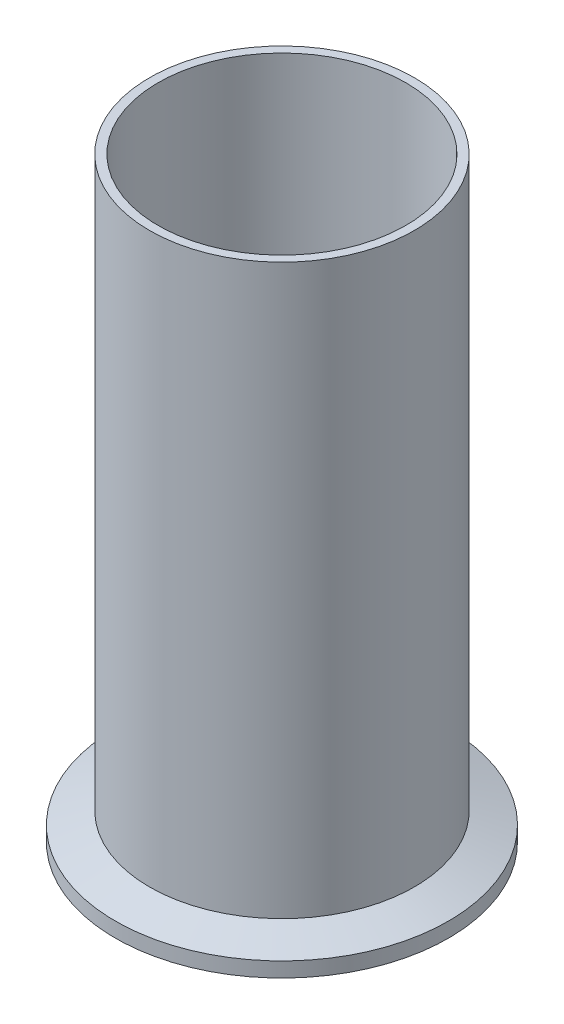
ISO-10303-21;
HEADER;
FILE_DESCRIPTION(('STEP AP214'),'2;1');
FILE_NAME('part.step','',(''),(''),'','','');
FILE_SCHEMA(('AUTOMOTIVE_DESIGN { 1 0 10303 214 1 1 1 1 }'));
ENDSEC;
DATA;
#1=APPLICATION_CONTEXT('core data for automotive mechanical design processes');
#2=APPLICATION_PROTOCOL_DEFINITION('international standard','automotive_design',2000,#1);
#3=PRODUCT_CONTEXT('',#1,'mechanical');
#4=PRODUCT('Part','Part','',(#3));
#5=PRODUCT_RELATED_PRODUCT_CATEGORY('part','',(#4));
#6=PRODUCT_DEFINITION_FORMATION('','',#4);
#7=PRODUCT_DEFINITION_CONTEXT('part definition',#1,'design');
#8=PRODUCT_DEFINITION('design','',#6,#7);
#9=PRODUCT_DEFINITION_SHAPE('','',#8);
#10=(LENGTH_UNIT() NAMED_UNIT(*) SI_UNIT(.MILLI.,.METRE.));
#11=(NAMED_UNIT(*) PLANE_ANGLE_UNIT() SI_UNIT($,.RADIAN.));
#12=(NAMED_UNIT(*) SI_UNIT($,.STERADIAN.) SOLID_ANGLE_UNIT());
#13=UNCERTAINTY_MEASURE_WITH_UNIT(LENGTH_MEASURE(1.E-05),#10,'distance_accuracy_value','');
#14=(GEOMETRIC_REPRESENTATION_CONTEXT(3) GLOBAL_UNCERTAINTY_ASSIGNED_CONTEXT((#13)) GLOBAL_UNIT_ASSIGNED_CONTEXT((#10,
#11,#12)) REPRESENTATION_CONTEXT('',''));
#15=CARTESIAN_POINT('',(0.,0.,0.));
#16=DIRECTION('',(0.,0.,1.));
#17=DIRECTION('',(1.,0.,0.));
#18=AXIS2_PLACEMENT_3D('',#15,#16,#17);
#19=CARTESIAN_POINT('',(0.,0.7874,0.));
#20=DIRECTION('',(0.,-1.,0.));
#21=DIRECTION('',(0.,0.,-1.));
#22=AXIS2_PLACEMENT_3D('',#19,#20,#21);
#23=TOROIDAL_SURFACE('',#22,29.9866084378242,0.787399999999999);
#24=CARTESIAN_POINT('',(0.,0.,0.));
#25=DIRECTION('',(0.,-1.,0.));
#26=DIRECTION('',(0.,0.,-1.));
#27=AXIS2_PLACEMENT_3D('',#24,#25,#26);
#28=CIRCLE('',#27,29.9866084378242);
#29=CARTESIAN_POINT('',(0.,0.,-29.9866084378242));
#30=VERTEX_POINT('',#29);
#31=EDGE_CURVE('E67',#30,#30,#28,.T.);
#32=ORIENTED_EDGE('',*,*,#31,.T.);
#33=EDGE_LOOP('',(#32));
#34=FACE_BOUND('',#33,.T.);
#35=CARTESIAN_POINT('',(0.,0.474458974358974,0.));
#36=DIRECTION('',(0.,-1.,0.));
#37=DIRECTION('',(0.,0.,-1.));
#38=AXIS2_PLACEMENT_3D('',#35,#36,#37);
#39=CIRCLE('',#38,29.2640666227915);
#40=CARTESIAN_POINT('',(0.,0.474458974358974,-29.2640666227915));
#41=VERTEX_POINT('',#40);
#42=EDGE_CURVE('E10',#41,#41,#39,.T.);
#43=ORIENTED_EDGE('',*,*,#42,.F.);
#44=EDGE_LOOP('',(#43));
#45=FACE_BOUND('',#44,.T.);
#46=ADVANCED_FACE('F33',(#34,#45),#23,.T.);
#47=CARTESIAN_POINT('',(0.,0.,0.));
#48=DIRECTION('',(0.,-1.,0.));
#49=DIRECTION('',(0.,0.,-1.));
#50=AXIS2_PLACEMENT_3D('',#47,#48,#49);
#51=TOROIDAL_SURFACE('',#50,28.1686,1.1938);
#52=CARTESIAN_POINT('',(0.,0.474458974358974,0.));
#53=DIRECTION('',(0.,-1.,0.));
#54=DIRECTION('',(0.,0.,-1.));
#55=AXIS2_PLACEMENT_3D('',#52,#53,#54);
#56=CIRCLE('',#55,27.0731333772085);
#57=CARTESIAN_POINT('',(0.,0.474458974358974,-27.0731333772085));
#58=VERTEX_POINT('',#57);
#59=EDGE_CURVE('E39',#58,#58,#56,.T.);
#60=ORIENTED_EDGE('',*,*,#59,.F.);
#61=EDGE_LOOP('',(#60));
#62=FACE_BOUND('',#61,.T.);
#63=ORIENTED_EDGE('',*,*,#42,.T.);
#64=EDGE_LOOP('',(#63));
#65=FACE_BOUND('',#64,.T.);
#66=ADVANCED_FACE('F115',(#62,#65),#51,.F.);
#67=CARTESIAN_POINT('',(0.,0.7874,0.));
#68=DIRECTION('',(0.,-1.,0.));
#69=DIRECTION('',(0.,0.,-1.));
#70=AXIS2_PLACEMENT_3D('',#67,#68,#69);
#71=TOROIDAL_SURFACE('',#70,26.3505915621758,0.787399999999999);
#72=ORIENTED_EDGE('',*,*,#59,.T.);
#73=EDGE_LOOP('',(#72));
#74=FACE_BOUND('',#73,.T.);
#75=CARTESIAN_POINT('',(0.,0.,0.));
#76=DIRECTION('',(0.,-1.,0.));
#77=DIRECTION('',(0.,0.,-1.));
#78=AXIS2_PLACEMENT_3D('',#75,#76,#77);
#79=CIRCLE('',#78,26.3505915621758);
#80=CARTESIAN_POINT('',(0.,0.,-26.3505915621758));
#81=VERTEX_POINT('',#80);
#82=EDGE_CURVE('E43',#81,#81,#79,.T.);
#83=ORIENTED_EDGE('',*,*,#82,.F.);
#84=EDGE_LOOP('',(#83));
#85=FACE_BOUND('',#84,.T.);
#86=ADVANCED_FACE('F111',(#74,#85),#71,.T.);
#87=CARTESIAN_POINT('',(0.,0.,0.));
#88=DIRECTION('',(0.,1.,0.));
#89=DIRECTION('',(0.,0.,1.));
#90=AXIS2_PLACEMENT_3D('',#87,#88,#89);
#91=PLANE('',#90);
#92=CARTESIAN_POINT('',(0.,0.,0.));
#93=DIRECTION('',(0.,-1.,0.));
#94=DIRECTION('',(0.,0.,-1.));
#95=AXIS2_PLACEMENT_3D('',#92,#93,#94);
#96=CIRCLE('',#95,23.749);
#97=CARTESIAN_POINT('',(0.,0.,-23.749));
#98=VERTEX_POINT('',#97);
#99=EDGE_CURVE('E47',#98,#98,#96,.T.);
#100=ORIENTED_EDGE('',*,*,#99,.F.);
#101=EDGE_LOOP('',(#100));
#102=FACE_BOUND('',#101,.T.);
#103=ORIENTED_EDGE('',*,*,#82,.T.);
#104=EDGE_LOOP('',(#103));
#105=FACE_BOUND('',#104,.T.);
#106=ADVANCED_FACE('F105',(#102,#105),#91,.F.);
#107=CARTESIAN_POINT('',(0.,0.,0.));
#108=DIRECTION('',(0.,-1.,0.));
#109=DIRECTION('',(0.,0.,-1.));
#110=AXIS2_PLACEMENT_3D('',#107,#108,#109);
#111=CYLINDRICAL_SURFACE('',#110,23.749);
#112=ORIENTED_EDGE('',*,*,#99,.T.);
#113=EDGE_LOOP('',(#112));
#114=FACE_BOUND('',#113,.T.);
#115=CARTESIAN_POINT('',(0.,114.3,0.));
#116=DIRECTION('',(0.,-1.,0.));
#117=DIRECTION('',(0.,0.,-1.));
#118=AXIS2_PLACEMENT_3D('',#115,#116,#117);
#119=CIRCLE('',#118,23.749);
#120=CARTESIAN_POINT('',(0.,114.3,-23.749));
#121=VERTEX_POINT('',#120);
#122=EDGE_CURVE('E52',#121,#121,#119,.T.);
#123=ORIENTED_EDGE('',*,*,#122,.F.);
#124=EDGE_LOOP('',(#123));
#125=FACE_BOUND('',#124,.T.);
#126=ADVANCED_FACE('F100',(#114,#125),#111,.F.);
#127=CARTESIAN_POINT('',(0.,114.3,0.));
#128=DIRECTION('',(0.,-1.,0.));
#129=DIRECTION('',(0.,0.,-1.));
#130=AXIS2_PLACEMENT_3D('',#127,#128,#129);
#131=PLANE('',#130);
#132=CARTESIAN_POINT('',(0.,114.3,0.));
#133=DIRECTION('',(0.,-1.,0.));
#134=DIRECTION('',(0.,0.,-1.));
#135=AXIS2_PLACEMENT_3D('',#132,#133,#134);
#136=CIRCLE('',#135,25.4);
#137=CARTESIAN_POINT('',(0.,114.3,-25.4));
#138=VERTEX_POINT('',#137);
#139=EDGE_CURVE('E55',#138,#138,#136,.T.);
#140=ORIENTED_EDGE('',*,*,#139,.F.);
#141=EDGE_LOOP('',(#140));
#142=FACE_BOUND('',#141,.T.);
#143=ORIENTED_EDGE('',*,*,#122,.T.);
#144=EDGE_LOOP('',(#143));
#145=FACE_BOUND('',#144,.T.);
#146=ADVANCED_FACE('F94',(#142,#145),#131,.F.);
#147=CARTESIAN_POINT('',(0.,0.,0.));
#148=DIRECTION('',(0.,-1.,0.));
#149=DIRECTION('',(0.,0.,-1.));
#150=AXIS2_PLACEMENT_3D('',#147,#148,#149);
#151=CYLINDRICAL_SURFACE('',#150,25.4);
#152=CARTESIAN_POINT('',(0.,5.22996973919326,0.));
#153=DIRECTION('',(0.,-1.,0.));
#154=DIRECTION('',(0.,0.,-1.));
#155=AXIS2_PLACEMENT_3D('',#152,#153,#154);
#156=CIRCLE('',#155,25.4);
#157=CARTESIAN_POINT('',(0.,5.22996973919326,-25.4));
#158=VERTEX_POINT('',#157);
#159=EDGE_CURVE('E58',#158,#158,#156,.T.);
#160=ORIENTED_EDGE('',*,*,#159,.F.);
#161=EDGE_LOOP('',(#160));
#162=FACE_BOUND('',#161,.T.);
#163=ORIENTED_EDGE('',*,*,#139,.T.);
#164=EDGE_LOOP('',(#163));
#165=FACE_BOUND('',#164,.T.);
#166=ADVANCED_FACE('F88',(#162,#165),#151,.T.);
#167=CARTESIAN_POINT('',(0.,5.22996973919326,0.));
#168=DIRECTION('',(0.,-1.,0.));
#169=DIRECTION('',(0.,0.,-1.));
#170=AXIS2_PLACEMENT_3D('',#167,#168,#169);
#171=CONICAL_SURFACE('',#170,25.4,1.22173047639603);
#172=CARTESIAN_POINT('',(0.,2.8448,0.));
#173=DIRECTION('',(0.,-1.,0.));
#174=DIRECTION('',(0.,0.,-1.));
#175=AXIS2_PLACEMENT_3D('',#172,#173,#174);
#176=CIRCLE('',#175,31.9532);
#177=CARTESIAN_POINT('',(0.,2.8448,-31.9532));
#178=VERTEX_POINT('',#177);
#179=EDGE_CURVE('E61',#178,#178,#176,.T.);
#180=ORIENTED_EDGE('',*,*,#179,.F.);
#181=EDGE_LOOP('',(#180));
#182=FACE_BOUND('',#181,.T.);
#183=ORIENTED_EDGE('',*,*,#159,.T.);
#184=EDGE_LOOP('',(#183));
#185=FACE_BOUND('',#184,.T.);
#186=ADVANCED_FACE('F82',(#182,#185),#171,.T.);
#187=CARTESIAN_POINT('',(0.,0.,0.));
#188=DIRECTION('',(0.,-1.,0.));
#189=DIRECTION('',(0.,0.,-1.));
#190=AXIS2_PLACEMENT_3D('',#187,#188,#189);
#191=CYLINDRICAL_SURFACE('',#190,31.9532);
#192=CARTESIAN_POINT('',(0.,0.,0.));
#193=DIRECTION('',(0.,-1.,0.));
#194=DIRECTION('',(0.,0.,-1.));
#195=AXIS2_PLACEMENT_3D('',#192,#193,#194);
#196=CIRCLE('',#195,31.9532);
#197=CARTESIAN_POINT('',(0.,0.,-31.9532));
#198=VERTEX_POINT('',#197);
#199=EDGE_CURVE('E64',#198,#198,#196,.T.);
#200=ORIENTED_EDGE('',*,*,#199,.F.);
#201=EDGE_LOOP('',(#200));
#202=FACE_BOUND('',#201,.T.);
#203=ORIENTED_EDGE('',*,*,#179,.T.);
#204=EDGE_LOOP('',(#203));
#205=FACE_BOUND('',#204,.T.);
#206=ADVANCED_FACE('F76',(#202,#205),#191,.T.);
#207=CARTESIAN_POINT('',(0.,0.,0.));
#208=DIRECTION('',(0.,1.,0.));
#209=DIRECTION('',(0.,0.,1.));
#210=AXIS2_PLACEMENT_3D('',#207,#208,#209);
#211=PLANE('',#210);
#212=ORIENTED_EDGE('',*,*,#31,.F.);
#213=EDGE_LOOP('',(#212));
#214=FACE_BOUND('',#213,.T.);
#215=ORIENTED_EDGE('',*,*,#199,.T.);
#216=EDGE_LOOP('',(#215));
#217=FACE_BOUND('',#216,.T.);
#218=ADVANCED_FACE('F73',(#214,#217),#211,.F.);
#219=CLOSED_SHELL('',(#46,#66,#86,#106,#126,#146,#166,#186,#206,#218));
#220=MANIFOLD_SOLID_BREP('B2',#219);
#221=ADVANCED_BREP_SHAPE_REPRESENTATION('',(#18,#220),#14);
#222=SHAPE_DEFINITION_REPRESENTATION(#9,#221);
ENDSEC;
END-ISO-10303-21;
